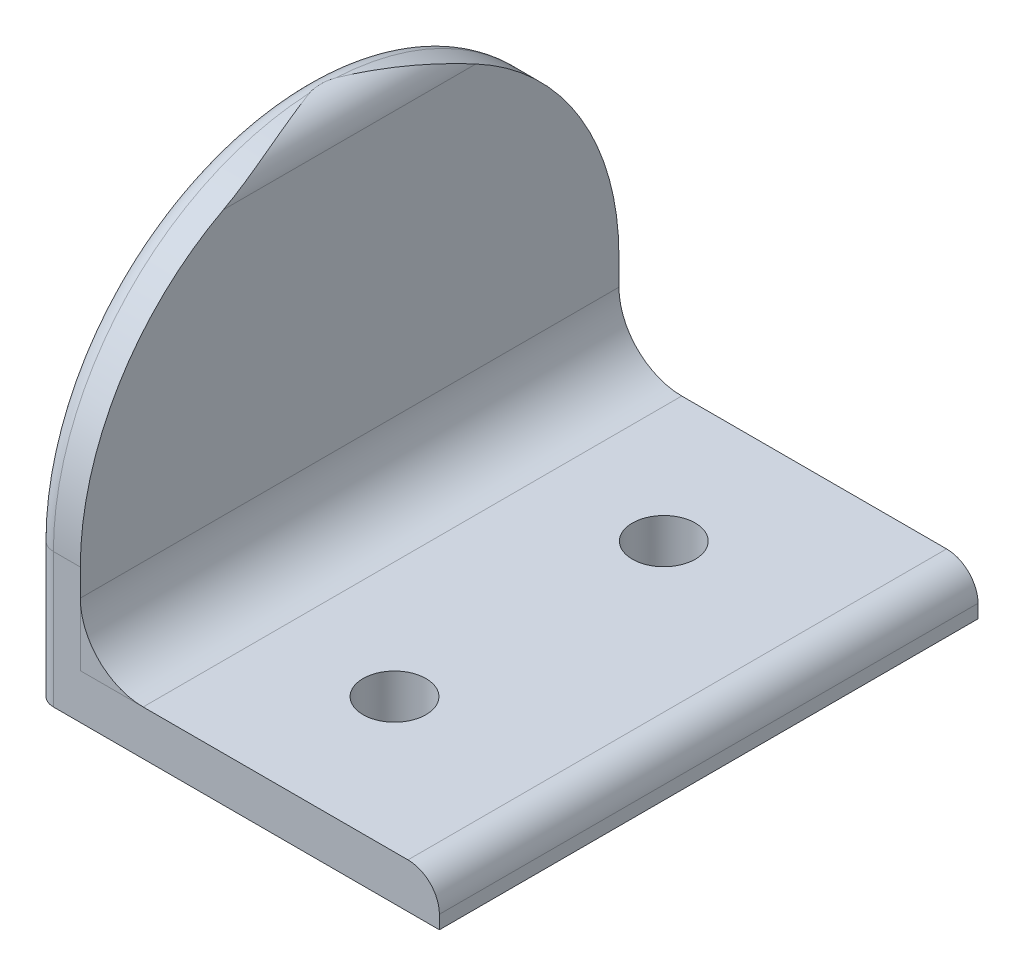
ISO-10303-21;
HEADER;
FILE_DESCRIPTION(('STEP AP214'),'2;1');
FILE_NAME('part.step','',(''),(''),'','','');
FILE_SCHEMA(('AUTOMOTIVE_DESIGN { 1 0 10303 214 1 1 1 1 }'));
ENDSEC;
DATA;
#1=APPLICATION_CONTEXT('core data for automotive mechanical design processes');
#2=APPLICATION_PROTOCOL_DEFINITION('international standard','automotive_design',2000,#1);
#3=PRODUCT_CONTEXT('',#1,'mechanical');
#4=PRODUCT('Part','Part','',(#3));
#5=PRODUCT_RELATED_PRODUCT_CATEGORY('part','',(#4));
#6=PRODUCT_DEFINITION_FORMATION('','',#4);
#7=PRODUCT_DEFINITION_CONTEXT('part definition',#1,'design');
#8=PRODUCT_DEFINITION('design','',#6,#7);
#9=PRODUCT_DEFINITION_SHAPE('','',#8);
#10=(LENGTH_UNIT() NAMED_UNIT(*) SI_UNIT(.MILLI.,.METRE.));
#11=(NAMED_UNIT(*) PLANE_ANGLE_UNIT() SI_UNIT($,.RADIAN.));
#12=(NAMED_UNIT(*) SI_UNIT($,.STERADIAN.) SOLID_ANGLE_UNIT());
#13=UNCERTAINTY_MEASURE_WITH_UNIT(LENGTH_MEASURE(1.E-05),#10,'distance_accuracy_value','');
#14=(GEOMETRIC_REPRESENTATION_CONTEXT(3) GLOBAL_UNCERTAINTY_ASSIGNED_CONTEXT((#13)) GLOBAL_UNIT_ASSIGNED_CONTEXT((#10,
#11,#12)) REPRESENTATION_CONTEXT('',''));
#15=CARTESIAN_POINT('',(0.,0.,0.));
#16=DIRECTION('',(0.,0.,1.));
#17=DIRECTION('',(1.,0.,0.));
#18=AXIS2_PLACEMENT_3D('',#15,#16,#17);
#19=CARTESIAN_POINT('',(45.,15.,0.));
#20=DIRECTION('',(-1.,0.,0.));
#21=DIRECTION('',(0.,0.,1.));
#22=AXIS2_PLACEMENT_3D('',#19,#20,#21);
#23=CYLINDRICAL_SURFACE('',#22,30.);
#24=DIRECTION('',(-1.,0.,0.));
#25=VECTOR('',#24,1.);
#26=CARTESIAN_POINT('',(45.,15.,-30.));
#27=LINE('',#26,#25);
#28=CARTESIAN_POINT('',(5.00000000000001,15.,-30.));
#29=VERTEX_POINT('',#28);
#30=CARTESIAN_POINT('',(2.00000000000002,15.,-30.));
#31=VERTEX_POINT('',#30);
#32=EDGE_CURVE('E126',#29,#31,#27,.T.);
#33=ORIENTED_EDGE('',*,*,#32,.T.);
#34=CARTESIAN_POINT('',(2.,15.,0.));
#35=DIRECTION('',(-1.,0.,0.));
#36=DIRECTION('',(0.,0.,1.));
#37=AXIS2_PLACEMENT_3D('',#34,#35,#36);
#38=CIRCLE('',#37,30.);
#39=CARTESIAN_POINT('',(2.,44.9641016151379,-1.46717906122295));
#40=VERTEX_POINT('',#39);
#41=EDGE_CURVE('E39',#31,#40,#38,.F.);
#42=ORIENTED_EDGE('',*,*,#41,.T.);
#43=CARTESIAN_POINT('',(5.,41.5,-14.0623611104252));
#44=CARTESIAN_POINT('',(4.99995944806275,41.6153530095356,-13.8449955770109));
#45=CARTESIAN_POINT('',(4.99429946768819,41.7279926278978,-13.6262588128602));
#46=CARTESIAN_POINT('',(4.97301920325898,41.9476333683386,-13.1865585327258));
#47=CARTESIAN_POINT('',(4.95740316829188,42.05463687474,-12.9655960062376));
#48=CARTESIAN_POINT('',(4.91752422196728,42.2626988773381,-12.5221861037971));
#49=CARTESIAN_POINT('',(4.89327743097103,42.3637680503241,-12.2997422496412));
#50=CARTESIAN_POINT('',(4.83715186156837,42.5601138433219,-11.8532533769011));
#51=CARTESIAN_POINT('',(4.80527218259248,42.6553897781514,-11.6292081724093));
#52=CARTESIAN_POINT('',(4.69999158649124,42.9313301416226,-10.9578251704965));
#53=CARTESIAN_POINT('',(4.61667674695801,43.1034037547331,-10.5084714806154));
#54=CARTESIAN_POINT('',(4.42924207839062,43.4246078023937,-9.60579981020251));
#55=CARTESIAN_POINT('',(4.32511195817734,43.5737268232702,-9.15247997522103));
#56=CARTESIAN_POINT('',(4.11344126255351,43.833376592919,-8.29537000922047));
#57=CARTESIAN_POINT('',(4.00767189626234,43.946373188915,-7.89188289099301));
#58=CARTESIAN_POINT('',(3.78589068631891,44.1547794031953,-7.08329882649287));
#59=CARTESIAN_POINT('',(3.66988090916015,44.2501925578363,-6.67820222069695));
#60=CARTESIAN_POINT('',(3.4296045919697,44.4238023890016,-5.86621156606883));
#61=CARTESIAN_POINT('',(3.30532791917,44.5019774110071,-5.45931590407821));
#62=CARTESIAN_POINT('',(3.05052828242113,44.6411674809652,-4.64456514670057));
#63=CARTESIAN_POINT('',(2.92000526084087,44.7021823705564,-4.2367100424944));
#64=CARTESIAN_POINT('',(2.58166588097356,44.8359953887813,-3.1967439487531));
#65=CARTESIAN_POINT('',(2.37066052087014,44.8969518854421,-2.56412355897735));
#66=CARTESIAN_POINT('',(1.94349671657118,44.9785837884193,-1.29854755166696));
#67=CARTESIAN_POINT('',(1.72734244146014,44.9992907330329,-0.665592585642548));
#68=CARTESIAN_POINT('',(1.50746466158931,44.9999940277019,-0.0218542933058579));
#69=CARTESIAN_POINT('',(1.50373232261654,44.9999999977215,-0.0109271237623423));
#70=CARTESIAN_POINT('',(1.5,45.,0.));
#71=B_SPLINE_CURVE_WITH_KNOTS('',3,(#43,#44,#45,#46,#47,#48,#49,#50,#51,#52,#53,#54,#55,#56,#57,
#58,#59,#60,#61,#62,#63,#64,#65,#66,#67,#68,#69,#70),.UNSPECIFIED.,.F.,.F.,(4,2,2,2,2,2,2,2,2,2,
2,2,2,4),(0.,0.738062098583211,1.47580941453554,2.21218594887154,2.94864940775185,
4.41239224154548,5.87686055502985,7.17281409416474,8.46850670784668,9.76581781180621,
11.0631408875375,13.0708275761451,15.076940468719,15.1115814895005),.UNSPECIFIED.);
#72=CARTESIAN_POINT('',(5.,41.5,-14.0623611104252));
#73=VERTEX_POINT('',#72);
#74=EDGE_CURVE('E127',#40,#73,#71,.F.);
#75=ORIENTED_EDGE('',*,*,#74,.T.);
#76=CARTESIAN_POINT('',(5.,15.,0.));
#77=DIRECTION('',(1.,0.,0.));
#78=DIRECTION('',(0.,0.,-1.));
#79=AXIS2_PLACEMENT_3D('',#76,#77,#78);
#80=CIRCLE('',#79,30.);
#81=EDGE_CURVE('E124',#73,#29,#80,.F.);
#82=ORIENTED_EDGE('',*,*,#81,.T.);
#83=EDGE_LOOP('',(#33,#42,#75,#82));
#84=FACE_BOUND('',#83,.T.);
#85=ADVANCED_FACE('F30',(#84),#23,.T.);
#86=CARTESIAN_POINT('',(5.,5.,30.));
#87=DIRECTION('',(0.,1.,0.));
#88=DIRECTION('',(0.,0.,1.));
#89=AXIS2_PLACEMENT_3D('',#86,#87,#88);
#90=PLANE('',#89);
#91=CARTESIAN_POINT('',(25.,5.,-15.));
#92=DIRECTION('',(0.,1.,0.));
#93=DIRECTION('',(0.,0.,1.));
#94=AXIS2_PLACEMENT_3D('',#91,#92,#93);
#95=CIRCLE('',#94,3.5);
#96=CARTESIAN_POINT('',(25.,5.,-11.5));
#97=VERTEX_POINT('',#96);
#98=EDGE_CURVE('E285',#97,#97,#95,.T.);
#99=ORIENTED_EDGE('',*,*,#98,.F.);
#100=EDGE_LOOP('',(#99));
#101=FACE_BOUND('',#100,.T.);
#102=CARTESIAN_POINT('',(25.,5.,15.));
#103=DIRECTION('',(0.,1.,0.));
#104=DIRECTION('',(0.,0.,1.));
#105=AXIS2_PLACEMENT_3D('',#102,#103,#104);
#106=CIRCLE('',#105,3.5);
#107=CARTESIAN_POINT('',(25.,5.,18.5));
#108=VERTEX_POINT('',#107);
#109=EDGE_CURVE('E291',#108,#108,#106,.T.);
#110=ORIENTED_EDGE('',*,*,#109,.F.);
#111=EDGE_LOOP('',(#110));
#112=FACE_BOUND('',#111,.T.);
#113=DIRECTION('',(1.,0.,0.));
#114=VECTOR('',#113,1.);
#115=CARTESIAN_POINT('',(5.,5.,-30.));
#116=LINE('',#115,#114);
#117=CARTESIAN_POINT('',(12.,5.,-30.));
#118=VERTEX_POINT('',#117);
#119=CARTESIAN_POINT('',(41.5,5.,-30.));
#120=VERTEX_POINT('',#119);
#121=EDGE_CURVE('E156',#118,#120,#116,.T.);
#122=ORIENTED_EDGE('',*,*,#121,.F.);
#123=DIRECTION('',(0.,0.,1.));
#124=VECTOR('',#123,1.);
#125=CARTESIAN_POINT('',(12.,5.,-30.));
#126=LINE('',#125,#124);
#127=CARTESIAN_POINT('',(12.,5.,30.));
#128=VERTEX_POINT('',#127);
#129=EDGE_CURVE('E302',#118,#128,#126,.T.);
#130=ORIENTED_EDGE('',*,*,#129,.T.);
#131=DIRECTION('',(1.,0.,0.));
#132=VECTOR('',#131,1.);
#133=CARTESIAN_POINT('',(5.,5.,30.));
#134=LINE('',#133,#132);
#135=CARTESIAN_POINT('',(41.5,5.,30.));
#136=VERTEX_POINT('',#135);
#137=EDGE_CURVE('E172',#128,#136,#134,.T.);
#138=ORIENTED_EDGE('',*,*,#137,.T.);
#139=DIRECTION('',(0.,0.,1.));
#140=VECTOR('',#139,1.);
#141=CARTESIAN_POINT('',(41.5,5.,-30.));
#142=LINE('',#141,#140);
#143=EDGE_CURVE('E316',#120,#136,#142,.T.);
#144=ORIENTED_EDGE('',*,*,#143,.F.);
#145=EDGE_LOOP('',(#122,#130,#138,#144));
#146=FACE_BOUND('',#145,.T.);
#147=ADVANCED_FACE('F228',(#101,#112,#146),#90,.T.);
#148=CARTESIAN_POINT('',(45.,0.,30.));
#149=DIRECTION('',(0.,0.,-1.));
#150=DIRECTION('',(-1.,0.,0.));
#151=AXIS2_PLACEMENT_3D('',#148,#149,#150);
#152=PLANE('',#151);
#153=DIRECTION('',(-1.,0.,0.));
#154=VECTOR('',#153,1.);
#155=CARTESIAN_POINT('',(45.,15.,30.));
#156=LINE('',#155,#154);
#157=CARTESIAN_POINT('',(5.00000000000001,15.,30.));
#158=VERTEX_POINT('',#157);
#159=CARTESIAN_POINT('',(2.00000000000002,15.,30.));
#160=VERTEX_POINT('',#159);
#161=EDGE_CURVE('E143',#158,#160,#156,.T.);
#162=ORIENTED_EDGE('',*,*,#161,.T.);
#163=DIRECTION('',(0.,1.,0.));
#164=VECTOR('',#163,1.);
#165=CARTESIAN_POINT('',(2.,0.,30.));
#166=LINE('',#165,#164);
#167=CARTESIAN_POINT('',(2.,0.,30.));
#168=VERTEX_POINT('',#167);
#169=EDGE_CURVE('E261',#160,#168,#166,.F.);
#170=ORIENTED_EDGE('',*,*,#169,.T.);
#171=DIRECTION('',(1.,0.,0.));
#172=VECTOR('',#171,1.);
#173=CARTESIAN_POINT('',(0.,0.,30.));
#174=LINE('',#173,#172);
#175=CARTESIAN_POINT('',(45.,0.,30.));
#176=VERTEX_POINT('',#175);
#177=EDGE_CURVE('E150',#168,#176,#174,.T.);
#178=ORIENTED_EDGE('',*,*,#177,.T.);
#179=DIRECTION('',(0.,-1.,0.));
#180=VECTOR('',#179,1.);
#181=CARTESIAN_POINT('',(45.,5.,30.));
#182=LINE('',#181,#180);
#183=CARTESIAN_POINT('',(45.,1.5,30.));
#184=VERTEX_POINT('',#183);
#185=EDGE_CURVE('E153',#184,#176,#182,.T.);
#186=ORIENTED_EDGE('',*,*,#185,.F.);
#187=CARTESIAN_POINT('',(41.5,1.5,30.));
#188=DIRECTION('',(0.,0.,-1.));
#189=DIRECTION('',(0.,1.,0.));
#190=AXIS2_PLACEMENT_3D('',#187,#188,#189);
#191=CIRCLE('',#190,3.5);
#192=EDGE_CURVE('E312',#136,#184,#191,.T.);
#193=ORIENTED_EDGE('',*,*,#192,.F.);
#194=ORIENTED_EDGE('',*,*,#137,.F.);
#195=CARTESIAN_POINT('',(5.,5.,30.));
#196=VERTEX_POINT('',#195);
#197=EDGE_CURVE('E170',#196,#128,#134,.T.);
#198=ORIENTED_EDGE('',*,*,#197,.F.);
#199=DIRECTION('',(0.,1.,0.));
#200=VECTOR('',#199,1.);
#201=CARTESIAN_POINT('',(5.,8.5,30.));
#202=LINE('',#201,#200);
#203=CARTESIAN_POINT('',(5.,12.,30.));
#204=VERTEX_POINT('',#203);
#205=EDGE_CURVE('E306',#196,#204,#202,.T.);
#206=ORIENTED_EDGE('',*,*,#205,.T.);
#207=DIRECTION('',(0.,-1.,0.));
#208=VECTOR('',#207,1.);
#209=CARTESIAN_POINT('',(5.,45.,30.));
#210=LINE('',#209,#208);
#211=EDGE_CURVE('E167',#158,#204,#210,.T.);
#212=ORIENTED_EDGE('',*,*,#211,.F.);
#213=EDGE_LOOP('',(#162,#170,#178,#186,#193,#194,#198,#206,#212));
#214=FACE_BOUND('',#213,.T.);
#215=ADVANCED_FACE('F231',(#214),#152,.F.);
#216=CARTESIAN_POINT('',(45.,0.,-30.));
#217=DIRECTION('',(0.,0.,-1.));
#218=DIRECTION('',(-1.,0.,0.));
#219=AXIS2_PLACEMENT_3D('',#216,#217,#218);
#220=PLANE('',#219);
#221=DIRECTION('',(1.,0.,0.));
#222=VECTOR('',#221,1.);
#223=CARTESIAN_POINT('',(0.,0.,-30.));
#224=LINE('',#223,#222);
#225=CARTESIAN_POINT('',(2.,0.,-30.));
#226=VERTEX_POINT('',#225);
#227=CARTESIAN_POINT('',(45.,0.,-30.));
#228=VERTEX_POINT('',#227);
#229=EDGE_CURVE('E165',#226,#228,#224,.T.);
#230=ORIENTED_EDGE('',*,*,#229,.F.);
#231=DIRECTION('',(0.,1.,0.));
#232=VECTOR('',#231,1.);
#233=CARTESIAN_POINT('',(2.,0.,-30.));
#234=LINE('',#233,#232);
#235=EDGE_CURVE('E142',#226,#31,#234,.T.);
#236=ORIENTED_EDGE('',*,*,#235,.T.);
#237=ORIENTED_EDGE('',*,*,#32,.F.);
#238=DIRECTION('',(0.,-1.,0.));
#239=VECTOR('',#238,1.);
#240=CARTESIAN_POINT('',(5.,45.,-30.));
#241=LINE('',#240,#239);
#242=CARTESIAN_POINT('',(5.,12.,-30.));
#243=VERTEX_POINT('',#242);
#244=EDGE_CURVE('E139',#29,#243,#241,.T.);
#245=ORIENTED_EDGE('',*,*,#244,.T.);
#246=DIRECTION('',(0.,-1.,0.));
#247=VECTOR('',#246,1.);
#248=CARTESIAN_POINT('',(5.,8.5,-30.));
#249=LINE('',#248,#247);
#250=CARTESIAN_POINT('',(5.,5.,-30.));
#251=VERTEX_POINT('',#250);
#252=EDGE_CURVE('E300',#243,#251,#249,.T.);
#253=ORIENTED_EDGE('',*,*,#252,.T.);
#254=EDGE_CURVE('E151',#251,#118,#116,.T.);
#255=ORIENTED_EDGE('',*,*,#254,.T.);
#256=ORIENTED_EDGE('',*,*,#121,.T.);
#257=CARTESIAN_POINT('',(41.5,1.5,-30.));
#258=DIRECTION('',(0.,0.,1.));
#259=DIRECTION('',(0.,1.,0.));
#260=AXIS2_PLACEMENT_3D('',#257,#258,#259);
#261=CIRCLE('',#260,3.5);
#262=CARTESIAN_POINT('',(45.,1.5,-30.));
#263=VERTEX_POINT('',#262);
#264=EDGE_CURVE('E309',#263,#120,#261,.T.);
#265=ORIENTED_EDGE('',*,*,#264,.F.);
#266=DIRECTION('',(0.,-1.,0.));
#267=VECTOR('',#266,1.);
#268=CARTESIAN_POINT('',(45.,5.,-30.));
#269=LINE('',#268,#267);
#270=EDGE_CURVE('E162',#263,#228,#269,.T.);
#271=ORIENTED_EDGE('',*,*,#270,.T.);
#272=EDGE_LOOP('',(#230,#236,#237,#245,#253,#255,#256,#265,#271));
#273=FACE_BOUND('',#272,.T.);
#274=ADVANCED_FACE('F137',(#273),#220,.T.);
#275=CARTESIAN_POINT('',(45.,5.,30.));
#276=DIRECTION('',(1.,0.,0.));
#277=DIRECTION('',(0.,0.,-1.));
#278=AXIS2_PLACEMENT_3D('',#275,#276,#277);
#279=PLANE('',#278);
#280=ORIENTED_EDGE('',*,*,#270,.F.);
#281=DIRECTION('',(0.,0.,1.));
#282=VECTOR('',#281,1.);
#283=CARTESIAN_POINT('',(45.,1.5,-30.));
#284=LINE('',#283,#282);
#285=EDGE_CURVE('E314',#263,#184,#284,.T.);
#286=ORIENTED_EDGE('',*,*,#285,.T.);
#287=ORIENTED_EDGE('',*,*,#185,.T.);
#288=DIRECTION('',(0.,0.,-1.));
#289=VECTOR('',#288,1.);
#290=CARTESIAN_POINT('',(45.,0.,30.));
#291=LINE('',#290,#289);
#292=EDGE_CURVE('E175',#176,#228,#291,.T.);
#293=ORIENTED_EDGE('',*,*,#292,.T.);
#294=EDGE_LOOP('',(#280,#286,#287,#293));
#295=FACE_BOUND('',#294,.T.);
#296=ADVANCED_FACE('F224',(#295),#279,.T.);
#297=CARTESIAN_POINT('',(5.,45.,30.));
#298=DIRECTION('',(1.,0.,0.));
#299=DIRECTION('',(0.,0.,-1.));
#300=AXIS2_PLACEMENT_3D('',#297,#298,#299);
#301=PLANE('',#300);
#302=CARTESIAN_POINT('',(5.,41.5,14.0623611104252));
#303=VERTEX_POINT('',#302);
#304=EDGE_CURVE('E132',#158,#303,#80,.F.);
#305=ORIENTED_EDGE('',*,*,#304,.F.);
#306=ORIENTED_EDGE('',*,*,#211,.T.);
#307=DIRECTION('',(0.,0.,1.));
#308=VECTOR('',#307,1.);
#309=CARTESIAN_POINT('',(5.,12.,-30.));
#310=LINE('',#309,#308);
#311=EDGE_CURVE('E149',#243,#204,#310,.T.);
#312=ORIENTED_EDGE('',*,*,#311,.F.);
#313=ORIENTED_EDGE('',*,*,#244,.F.);
#314=ORIENTED_EDGE('',*,*,#81,.F.);
#315=DIRECTION('',(0.,0.,1.));
#316=VECTOR('',#315,1.);
#317=CARTESIAN_POINT('',(5.,41.5,-30.));
#318=LINE('',#317,#316);
#319=EDGE_CURVE('E159',#73,#303,#318,.T.);
#320=ORIENTED_EDGE('',*,*,#319,.T.);
#321=EDGE_LOOP('',(#305,#306,#312,#313,#314,#320));
#322=FACE_BOUND('',#321,.T.);
#323=ADVANCED_FACE('F147',(#322),#301,.T.);
#324=CARTESIAN_POINT('',(0.,0.,30.));
#325=DIRECTION('',(0.,1.,0.));
#326=DIRECTION('',(0.,0.,1.));
#327=AXIS2_PLACEMENT_3D('',#324,#325,#326);
#328=PLANE('',#327);
#329=CARTESIAN_POINT('',(25.,0.,-15.));
#330=DIRECTION('',(0.,-1.,0.));
#331=DIRECTION('',(0.,0.,-1.));
#332=AXIS2_PLACEMENT_3D('',#329,#330,#331);
#333=CIRCLE('',#332,3.5);
#334=CARTESIAN_POINT('',(25.,0.,-18.5));
#335=VERTEX_POINT('',#334);
#336=EDGE_CURVE('E282',#335,#335,#333,.T.);
#337=ORIENTED_EDGE('',*,*,#336,.F.);
#338=EDGE_LOOP('',(#337));
#339=FACE_BOUND('',#338,.T.);
#340=CARTESIAN_POINT('',(25.,0.,15.));
#341=DIRECTION('',(0.,-1.,0.));
#342=DIRECTION('',(0.,0.,-1.));
#343=AXIS2_PLACEMENT_3D('',#340,#341,#342);
#344=CIRCLE('',#343,3.5);
#345=CARTESIAN_POINT('',(25.,0.,11.5));
#346=VERTEX_POINT('',#345);
#347=EDGE_CURVE('E288',#346,#346,#344,.T.);
#348=ORIENTED_EDGE('',*,*,#347,.F.);
#349=EDGE_LOOP('',(#348));
#350=FACE_BOUND('',#349,.T.);
#351=DIRECTION('',(0.,0.,-1.));
#352=VECTOR('',#351,1.);
#353=CARTESIAN_POINT('',(0.,0.,30.));
#354=LINE('',#353,#352);
#355=CARTESIAN_POINT('',(0.,0.,28.));
#356=VERTEX_POINT('',#355);
#357=CARTESIAN_POINT('',(0.,0.,-28.));
#358=VERTEX_POINT('',#357);
#359=EDGE_CURVE('E169',#356,#358,#354,.T.);
#360=ORIENTED_EDGE('',*,*,#359,.T.);
#361=CARTESIAN_POINT('',(2.,0.,-28.));
#362=DIRECTION('',(0.,1.,0.));
#363=DIRECTION('',(0.,0.,1.));
#364=AXIS2_PLACEMENT_3D('',#361,#362,#363);
#365=CIRCLE('',#364,2.);
#366=EDGE_CURVE('E262',#358,#226,#365,.F.);
#367=ORIENTED_EDGE('',*,*,#366,.T.);
#368=ORIENTED_EDGE('',*,*,#229,.T.);
#369=ORIENTED_EDGE('',*,*,#292,.F.);
#370=ORIENTED_EDGE('',*,*,#177,.F.);
#371=CARTESIAN_POINT('',(2.,0.,28.));
#372=DIRECTION('',(0.,1.,0.));
#373=DIRECTION('',(0.,0.,1.));
#374=AXIS2_PLACEMENT_3D('',#371,#372,#373);
#375=CIRCLE('',#374,2.);
#376=EDGE_CURVE('E266',#168,#356,#375,.F.);
#377=ORIENTED_EDGE('',*,*,#376,.T.);
#378=EDGE_LOOP('',(#360,#367,#368,#369,#370,#377));
#379=FACE_BOUND('',#378,.T.);
#380=ADVANCED_FACE('F220',(#339,#350,#379),#328,.F.);
#381=CARTESIAN_POINT('',(0.,0.,30.));
#382=DIRECTION('',(-1.,0.,0.));
#383=DIRECTION('',(0.,0.,1.));
#384=AXIS2_PLACEMENT_3D('',#381,#382,#383);
#385=PLANE('',#384);
#386=CARTESIAN_POINT('',(0.,15.,0.));
#387=DIRECTION('',(-1.,0.,0.));
#388=DIRECTION('',(0.,0.,1.));
#389=AXIS2_PLACEMENT_3D('',#386,#387,#388);
#390=CIRCLE('',#389,28.);
#391=CARTESIAN_POINT('',(0.,15.,28.));
#392=VERTEX_POINT('',#391);
#393=CARTESIAN_POINT('',(0.,15.,-28.));
#394=VERTEX_POINT('',#393);
#395=EDGE_CURVE('E272',#392,#394,#390,.T.);
#396=ORIENTED_EDGE('',*,*,#395,.T.);
#397=DIRECTION('',(0.,1.,0.));
#398=VECTOR('',#397,1.);
#399=CARTESIAN_POINT('',(0.,0.,-28.));
#400=LINE('',#399,#398);
#401=EDGE_CURVE('E268',#394,#358,#400,.F.);
#402=ORIENTED_EDGE('',*,*,#401,.T.);
#403=ORIENTED_EDGE('',*,*,#359,.F.);
#404=DIRECTION('',(0.,1.,0.));
#405=VECTOR('',#404,1.);
#406=CARTESIAN_POINT('',(0.,15.,28.));
#407=LINE('',#406,#405);
#408=EDGE_CURVE('E270',#356,#392,#407,.T.);
#409=ORIENTED_EDGE('',*,*,#408,.T.);
#410=EDGE_LOOP('',(#396,#402,#403,#409));
#411=FACE_BOUND('',#410,.T.);
#412=ADVANCED_FACE('F200',(#411),#385,.T.);
#413=CARTESIAN_POINT('',(1.5,41.5,-30.));
#414=DIRECTION('',(0.,0.,1.));
#415=DIRECTION('',(0.,1.,0.));
#416=AXIS2_PLACEMENT_3D('',#413,#414,#415);
#417=CYLINDRICAL_SURFACE('',#416,3.5);
#418=ORIENTED_EDGE('',*,*,#74,.F.);
#419=CARTESIAN_POINT('',(2.,44.9641016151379,-1.46717906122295));
#420=CARTESIAN_POINT('',(1.98115858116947,44.9668135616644,-1.41155649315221));
#421=CARTESIAN_POINT('',(1.96391555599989,44.9691530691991,-1.35540060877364));
#422=CARTESIAN_POINT('',(1.93229578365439,44.9732388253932,-1.24229973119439));
#423=CARTESIAN_POINT('',(1.91791728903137,44.9749854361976,-1.18535524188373));
#424=CARTESIAN_POINT('',(1.89170569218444,44.9780362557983,-1.071024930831));
#425=CARTESIAN_POINT('',(1.87986649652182,44.9793415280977,-1.01364051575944));
#426=CARTESIAN_POINT('',(1.85846513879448,44.9816114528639,-0.898435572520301));
#427=CARTESIAN_POINT('',(1.8489033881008,44.9825760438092,-0.840614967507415));
#428=CARTESIAN_POINT('',(1.8237025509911,44.9850401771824,-0.668982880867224));
#429=CARTESIAN_POINT('',(1.81104411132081,44.986164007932,-0.554720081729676));
#430=CARTESIAN_POINT('',(1.7929702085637,44.9877277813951,-0.325523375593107));
#431=CARTESIAN_POINT('',(1.78756247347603,44.9881669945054,-0.210588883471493));
#432=CARTESIAN_POINT('',(1.78343321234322,44.9885059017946,0.0349794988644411));
#433=CARTESIAN_POINT('',(1.7857165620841,44.9883244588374,0.165631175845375));
#434=CARTESIAN_POINT('',(1.79939185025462,44.9871789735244,0.426353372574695));
#435=CARTESIAN_POINT('',(1.81077493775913,44.986215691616,0.55642433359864));
#436=CARTESIAN_POINT('',(1.83554971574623,44.983887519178,0.752043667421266));
#437=CARTESIAN_POINT('',(1.84524461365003,44.9829486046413,0.818075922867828));
#438=CARTESIAN_POINT('',(1.86748587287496,44.9806722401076,0.949641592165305));
#439=CARTESIAN_POINT('',(1.88003157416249,44.979334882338,1.01517511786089));
#440=CARTESIAN_POINT('',(1.90830454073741,44.9761324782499,1.14572061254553));
#441=CARTESIAN_POINT('',(1.9240395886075,44.9742661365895,1.21073089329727));
#442=CARTESIAN_POINT('',(1.9591611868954,44.9697929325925,1.33978087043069));
#443=CARTESIAN_POINT('',(1.9785506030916,44.9671854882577,1.40381976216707));
#444=CARTESIAN_POINT('',(1.99999999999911,44.9641016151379,1.46717906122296));
#445=B_SPLINE_CURVE_WITH_KNOTS('',3,(#419,#420,#421,#422,#423,#424,#425,#426,#427,#428,#429,
#430,#431,#432,#433,#434,#435,#436,#437,#438,#439,#440,#441,#442,#443,#444),.UNSPECIFIED.,.F.,
.F.,(4,2,2,2,2,2,2,2,2,2,2,2,4),(0.,0.176307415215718,0.352506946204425,0.528278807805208,
0.704082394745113,1.04869720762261,1.39367902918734,1.78538925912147,2.17671895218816,
2.37690739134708,2.57704952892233,2.77768605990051,2.97848059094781),.UNSPECIFIED.);
#446=CARTESIAN_POINT('',(2.00000000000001,44.9641016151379,1.46717906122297));
#447=VERTEX_POINT('',#446);
#448=EDGE_CURVE('E11',#40,#447,#445,.T.);
#449=ORIENTED_EDGE('',*,*,#448,.T.);
#450=CARTESIAN_POINT('',(5.,41.5,14.0623611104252));
#451=CARTESIAN_POINT('',(4.99995944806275,41.6153530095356,13.844995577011));
#452=CARTESIAN_POINT('',(4.99429946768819,41.7279926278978,13.6262588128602));
#453=CARTESIAN_POINT('',(4.97301920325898,41.9476333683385,13.1865585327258));
#454=CARTESIAN_POINT('',(4.95740316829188,42.05463687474,12.9655960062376));
#455=CARTESIAN_POINT('',(4.91752422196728,42.2626988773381,12.5221861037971));
#456=CARTESIAN_POINT('',(4.89327743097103,42.3637680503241,12.2997422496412));
#457=CARTESIAN_POINT('',(4.83715186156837,42.5601138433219,11.8532533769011));
#458=CARTESIAN_POINT('',(4.80527218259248,42.6553897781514,11.6292081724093));
#459=CARTESIAN_POINT('',(4.69999158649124,42.9313301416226,10.9578251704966));
#460=CARTESIAN_POINT('',(4.61667674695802,43.1034037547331,10.5084714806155));
#461=CARTESIAN_POINT('',(4.42924207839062,43.4246078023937,9.60579981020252));
#462=CARTESIAN_POINT('',(4.32511195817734,43.5737268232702,9.15247997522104));
#463=CARTESIAN_POINT('',(4.11344126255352,43.833376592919,8.29537000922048));
#464=CARTESIAN_POINT('',(4.00767189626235,43.946373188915,7.89188289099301));
#465=CARTESIAN_POINT('',(3.78589068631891,44.1547794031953,7.08329882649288));
#466=CARTESIAN_POINT('',(3.66988090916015,44.2501925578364,6.67820222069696));
#467=CARTESIAN_POINT('',(3.4296045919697,44.4238023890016,5.86621156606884));
#468=CARTESIAN_POINT('',(3.30532791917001,44.5019774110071,5.45931590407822));
#469=CARTESIAN_POINT('',(3.05052828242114,44.6411674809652,4.64456514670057));
#470=CARTESIAN_POINT('',(2.92000526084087,44.7021823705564,4.2367100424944));
#471=CARTESIAN_POINT('',(2.58166588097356,44.8359953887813,3.1967439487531));
#472=CARTESIAN_POINT('',(2.37066052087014,44.8969518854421,2.56412355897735));
#473=CARTESIAN_POINT('',(1.94349671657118,44.9785837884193,1.29854755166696));
#474=CARTESIAN_POINT('',(1.72734244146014,44.9992907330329,0.665592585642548));
#475=CARTESIAN_POINT('',(1.50746466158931,44.9999940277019,0.0218542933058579));
#476=CARTESIAN_POINT('',(1.50373232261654,44.9999999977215,0.0109271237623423));
#477=CARTESIAN_POINT('',(1.5,45.,0.));
#478=B_SPLINE_CURVE_WITH_KNOTS('',3,(#450,#451,#452,#453,#454,#455,#456,#457,#458,#459,#460,
#461,#462,#463,#464,#465,#466,#467,#468,#469,#470,#471,#472,#473,#474,#475,#476,#477),
.UNSPECIFIED.,.F.,.F.,(4,2,2,2,2,2,2,2,2,2,2,2,2,4),(0.,0.738062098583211,1.47580941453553,
2.21218594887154,2.94864940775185,4.41239224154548,5.87686055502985,7.17281409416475,
8.46850670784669,9.76581781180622,11.0631408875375,13.0708275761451,15.076940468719,
15.1115814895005),.UNSPECIFIED.);
#479=EDGE_CURVE('E186',#303,#447,#478,.T.);
#480=ORIENTED_EDGE('',*,*,#479,.F.);
#481=ORIENTED_EDGE('',*,*,#319,.F.);
#482=EDGE_LOOP('',(#418,#449,#480,#481));
#483=FACE_BOUND('',#482,.T.);
#484=ADVANCED_FACE('F194',(#483),#417,.T.);
#485=CARTESIAN_POINT('',(41.5,1.5,-30.));
#486=DIRECTION('',(0.,0.,1.));
#487=DIRECTION('',(0.,1.,0.));
#488=AXIS2_PLACEMENT_3D('',#485,#486,#487);
#489=CYLINDRICAL_SURFACE('',#488,3.5);
#490=ORIENTED_EDGE('',*,*,#264,.T.);
#491=ORIENTED_EDGE('',*,*,#143,.T.);
#492=ORIENTED_EDGE('',*,*,#192,.T.);
#493=ORIENTED_EDGE('',*,*,#285,.F.);
#494=EDGE_LOOP('',(#490,#491,#492,#493));
#495=FACE_BOUND('',#494,.T.);
#496=ADVANCED_FACE('F199',(#495),#489,.T.);
#497=CARTESIAN_POINT('',(8.5,8.5,30.));
#498=DIRECTION('',(0.,0.,1.));
#499=DIRECTION('',(1.,0.,0.));
#500=AXIS2_PLACEMENT_3D('',#497,#498,#499);
#501=PLANE('',#500);
#502=CARTESIAN_POINT('',(12.,12.,30.));
#503=DIRECTION('',(0.,0.,-1.));
#504=DIRECTION('',(0.,1.,0.));
#505=AXIS2_PLACEMENT_3D('',#502,#503,#504);
#506=CIRCLE('',#505,7.);
#507=EDGE_CURVE('E297',#128,#204,#506,.T.);
#508=ORIENTED_EDGE('',*,*,#507,.T.);
#509=ORIENTED_EDGE('',*,*,#205,.F.);
#510=ORIENTED_EDGE('',*,*,#197,.T.);
#511=EDGE_LOOP('',(#508,#509,#510));
#512=FACE_BOUND('',#511,.T.);
#513=ADVANCED_FACE('F324',(#512),#501,.T.);
#514=CARTESIAN_POINT('',(8.5,8.5,-30.));
#515=DIRECTION('',(0.,0.,-1.));
#516=DIRECTION('',(-1.,0.,0.));
#517=AXIS2_PLACEMENT_3D('',#514,#515,#516);
#518=PLANE('',#517);
#519=CARTESIAN_POINT('',(12.,12.,-30.));
#520=DIRECTION('',(0.,0.,1.));
#521=DIRECTION('',(0.,1.,0.));
#522=AXIS2_PLACEMENT_3D('',#519,#520,#521);
#523=CIRCLE('',#522,7.);
#524=EDGE_CURVE('E294',#243,#118,#523,.T.);
#525=ORIENTED_EDGE('',*,*,#524,.T.);
#526=ORIENTED_EDGE('',*,*,#254,.F.);
#527=ORIENTED_EDGE('',*,*,#252,.F.);
#528=EDGE_LOOP('',(#525,#526,#527));
#529=FACE_BOUND('',#528,.T.);
#530=ADVANCED_FACE('F336',(#529),#518,.T.);
#531=CARTESIAN_POINT('',(12.,12.,-30.));
#532=DIRECTION('',(0.,0.,1.));
#533=DIRECTION('',(0.,1.,0.));
#534=AXIS2_PLACEMENT_3D('',#531,#532,#533);
#535=CYLINDRICAL_SURFACE('',#534,7.);
#536=ORIENTED_EDGE('',*,*,#311,.T.);
#537=ORIENTED_EDGE('',*,*,#507,.F.);
#538=ORIENTED_EDGE('',*,*,#129,.F.);
#539=ORIENTED_EDGE('',*,*,#524,.F.);
#540=EDGE_LOOP('',(#536,#537,#538,#539));
#541=FACE_BOUND('',#540,.T.);
#542=ADVANCED_FACE('F327',(#541),#535,.F.);
#543=CARTESIAN_POINT('',(25.,10.,15.));
#544=DIRECTION('',(0.,-1.,0.));
#545=DIRECTION('',(0.,0.,-1.));
#546=AXIS2_PLACEMENT_3D('',#543,#544,#545);
#547=CYLINDRICAL_SURFACE('',#546,3.5);
#548=ORIENTED_EDGE('',*,*,#109,.T.);
#549=EDGE_LOOP('',(#548));
#550=FACE_BOUND('',#549,.T.);
#551=ORIENTED_EDGE('',*,*,#347,.T.);
#552=EDGE_LOOP('',(#551));
#553=FACE_BOUND('',#552,.T.);
#554=ADVANCED_FACE('F254',(#550,#553),#547,.F.);
#555=CARTESIAN_POINT('',(25.,10.,-15.));
#556=DIRECTION('',(0.,-1.,0.));
#557=DIRECTION('',(0.,0.,-1.));
#558=AXIS2_PLACEMENT_3D('',#555,#556,#557);
#559=CYLINDRICAL_SURFACE('',#558,3.5);
#560=ORIENTED_EDGE('',*,*,#98,.T.);
#561=EDGE_LOOP('',(#560));
#562=FACE_BOUND('',#561,.T.);
#563=ORIENTED_EDGE('',*,*,#336,.T.);
#564=EDGE_LOOP('',(#563));
#565=FACE_BOUND('',#564,.T.);
#566=ADVANCED_FACE('F247',(#562,#565),#559,.F.);
#567=ORIENTED_EDGE('',*,*,#479,.T.);
#568=CARTESIAN_POINT('',(2.,15.,0.));
#569=DIRECTION('',(-1.,0.,0.));
#570=DIRECTION('',(0.,0.,1.));
#571=AXIS2_PLACEMENT_3D('',#568,#569,#570);
#572=CIRCLE('',#571,30.);
#573=EDGE_CURVE('E257',#447,#160,#572,.F.);
#574=ORIENTED_EDGE('',*,*,#573,.T.);
#575=ORIENTED_EDGE('',*,*,#161,.F.);
#576=ORIENTED_EDGE('',*,*,#304,.T.);
#577=EDGE_LOOP('',(#567,#574,#575,#576));
#578=FACE_BOUND('',#577,.T.);
#579=ADVANCED_FACE('F191',(#578),#23,.T.);
#580=CARTESIAN_POINT('',(2.,0.,28.));
#581=DIRECTION('',(0.,-1.,0.));
#582=DIRECTION('',(0.,0.,-1.));
#583=AXIS2_PLACEMENT_3D('',#580,#581,#582);
#584=CYLINDRICAL_SURFACE('',#583,2.);
#585=ORIENTED_EDGE('',*,*,#376,.F.);
#586=ORIENTED_EDGE('',*,*,#169,.F.);
#587=CARTESIAN_POINT('',(2.,15.,28.));
#588=DIRECTION('',(0.,1.,0.));
#589=DIRECTION('',(0.,0.,1.));
#590=AXIS2_PLACEMENT_3D('',#587,#588,#589);
#591=CIRCLE('',#590,2.);
#592=EDGE_CURVE('E34',#392,#160,#591,.T.);
#593=ORIENTED_EDGE('',*,*,#592,.F.);
#594=ORIENTED_EDGE('',*,*,#408,.F.);
#595=EDGE_LOOP('',(#585,#586,#593,#594));
#596=FACE_BOUND('',#595,.T.);
#597=ADVANCED_FACE('F32',(#596),#584,.T.);
#598=CARTESIAN_POINT('',(2.,15.,0.));
#599=DIRECTION('',(-1.,0.,0.));
#600=DIRECTION('',(0.,0.,1.));
#601=AXIS2_PLACEMENT_3D('',#598,#599,#600);
#602=TOROIDAL_SURFACE('',#601,28.,2.);
#603=ORIENTED_EDGE('',*,*,#448,.F.);
#604=ORIENTED_EDGE('',*,*,#41,.F.);
#605=CARTESIAN_POINT('',(2.,15.,-28.));
#606=DIRECTION('',(0.,-1.,0.));
#607=DIRECTION('',(0.,0.,-1.));
#608=AXIS2_PLACEMENT_3D('',#605,#606,#607);
#609=CIRCLE('',#608,2.);
#610=EDGE_CURVE('E210',#394,#31,#609,.T.);
#611=ORIENTED_EDGE('',*,*,#610,.F.);
#612=ORIENTED_EDGE('',*,*,#395,.F.);
#613=ORIENTED_EDGE('',*,*,#592,.T.);
#614=ORIENTED_EDGE('',*,*,#573,.F.);
#615=EDGE_LOOP('',(#603,#604,#611,#612,#613,#614));
#616=FACE_BOUND('',#615,.T.);
#617=ADVANCED_FACE('F211',(#616),#602,.T.);
#618=CARTESIAN_POINT('',(2.,0.,-28.));
#619=DIRECTION('',(0.,1.,0.));
#620=DIRECTION('',(0.,0.,1.));
#621=AXIS2_PLACEMENT_3D('',#618,#619,#620);
#622=CYLINDRICAL_SURFACE('',#621,2.);
#623=ORIENTED_EDGE('',*,*,#366,.F.);
#624=ORIENTED_EDGE('',*,*,#401,.F.);
#625=ORIENTED_EDGE('',*,*,#610,.T.);
#626=ORIENTED_EDGE('',*,*,#235,.F.);
#627=EDGE_LOOP('',(#623,#624,#625,#626));
#628=FACE_BOUND('',#627,.T.);
#629=ADVANCED_FACE('F215',(#628),#622,.T.);
#630=CLOSED_SHELL('',(#85,#147,#215,#274,#296,#323,#380,#412,#484,#496,#513,#530,#542,#554,#566,
#579,#597,#617,#629));
#631=MANIFOLD_SOLID_BREP('B2',#630);
#632=ADVANCED_BREP_SHAPE_REPRESENTATION('',(#18,#631),#14);
#633=SHAPE_DEFINITION_REPRESENTATION(#9,#632);
ENDSEC;
END-ISO-10303-21;
